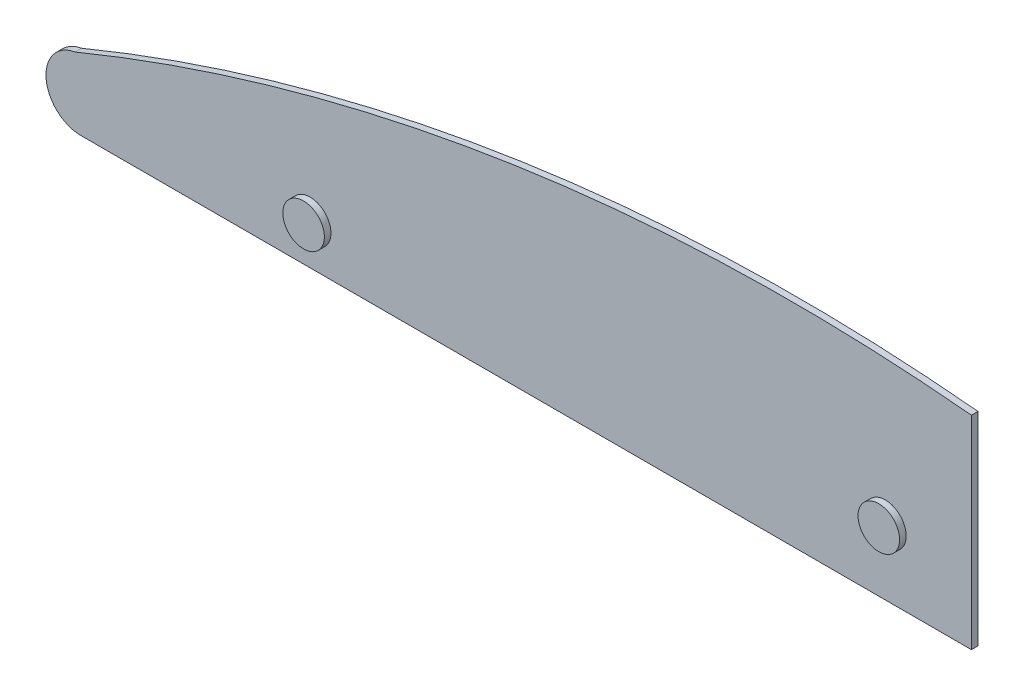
ISO-10303-21;
HEADER;
FILE_DESCRIPTION(('STEP AP214'),'2;1');
FILE_NAME('part.step','',(''),(''),'','','');
FILE_SCHEMA(('AUTOMOTIVE_DESIGN { 1 0 10303 214 1 1 1 1 }'));
ENDSEC;
DATA;
#1=APPLICATION_CONTEXT('core data for automotive mechanical design processes');
#2=APPLICATION_PROTOCOL_DEFINITION('international standard','automotive_design',2000,#1);
#3=PRODUCT_CONTEXT('',#1,'mechanical');
#4=PRODUCT('Part','Part','',(#3));
#5=PRODUCT_RELATED_PRODUCT_CATEGORY('part','',(#4));
#6=PRODUCT_DEFINITION_FORMATION('','',#4);
#7=PRODUCT_DEFINITION_CONTEXT('part definition',#1,'design');
#8=PRODUCT_DEFINITION('design','',#6,#7);
#9=PRODUCT_DEFINITION_SHAPE('','',#8);
#10=(LENGTH_UNIT() NAMED_UNIT(*) SI_UNIT(.MILLI.,.METRE.));
#11=(NAMED_UNIT(*) PLANE_ANGLE_UNIT() SI_UNIT($,.RADIAN.));
#12=(NAMED_UNIT(*) SI_UNIT($,.STERADIAN.) SOLID_ANGLE_UNIT());
#13=UNCERTAINTY_MEASURE_WITH_UNIT(LENGTH_MEASURE(1.E-05),#10,'distance_accuracy_value','');
#14=(GEOMETRIC_REPRESENTATION_CONTEXT(3) GLOBAL_UNCERTAINTY_ASSIGNED_CONTEXT((#13)) GLOBAL_UNIT_ASSIGNED_CONTEXT((#10,
#11,#12)) REPRESENTATION_CONTEXT('',''));
#15=CARTESIAN_POINT('',(0.,0.,0.));
#16=DIRECTION('',(0.,0.,1.));
#17=DIRECTION('',(1.,0.,0.));
#18=AXIS2_PLACEMENT_3D('',#15,#16,#17);
#19=CARTESIAN_POINT('',(-66.7637298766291,-682.284266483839,2.667));
#20=DIRECTION('',(0.,0.,1.));
#21=DIRECTION('',(1.,0.,0.));
#22=AXIS2_PLACEMENT_3D('',#19,#20,#21);
#23=PLANE('',#22);
#24=CARTESIAN_POINT('',(-262.437432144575,10.1041067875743,2.667));
#25=DIRECTION('',(0.,0.,1.));
#26=DIRECTION('',(1.,0.,0.));
#27=AXIS2_PLACEMENT_3D('',#24,#25,#26);
#28=CIRCLE('',#27,8.45095856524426);
#29=CARTESIAN_POINT('',(-253.986473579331,10.1041067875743,2.667));
#30=VERTEX_POINT('',#29);
#31=EDGE_CURVE('E89',#30,#30,#28,.T.);
#32=ORIENTED_EDGE('',*,*,#31,.F.);
#33=EDGE_LOOP('',(#32));
#34=FACE_BOUND('',#33,.T.);
#35=DIRECTION('',(1.,0.,0.));
#36=VECTOR('',#35,1.);
#37=CARTESIAN_POINT('',(-355.6,-6.35000000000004,2.667));
#38=LINE('',#37,#36);
#39=CARTESIAN_POINT('',(-355.6,-6.35000000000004,2.667));
#40=VERTEX_POINT('',#39);
#41=CARTESIAN_POINT('',(6.35000000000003,-6.35,2.667));
#42=VERTEX_POINT('',#41);
#43=EDGE_CURVE('E96',#40,#42,#38,.T.);
#44=ORIENTED_EDGE('',*,*,#43,.T.);
#45=DIRECTION('',(0.,1.,0.));
#46=VECTOR('',#45,1.);
#47=CARTESIAN_POINT('',(6.35000000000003,-6.35,2.667));
#48=LINE('',#47,#46);
#49=CARTESIAN_POINT('',(6.35000000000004,76.2,2.667));
#50=VERTEX_POINT('',#49);
#51=EDGE_CURVE('E81',#42,#50,#48,.T.);
#52=ORIENTED_EDGE('',*,*,#51,.T.);
#53=CARTESIAN_POINT('',(-66.7637298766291,-682.284266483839,2.667));
#54=DIRECTION('',(0.,0.,1.));
#55=DIRECTION('',(1.,0.,0.));
#56=AXIS2_PLACEMENT_3D('',#53,#54,#55);
#57=CIRCLE('',#56,762.);
#58=CARTESIAN_POINT('',(-357.978470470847,21.8733684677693,2.667));
#59=VERTEX_POINT('',#58);
#60=EDGE_CURVE('E48',#50,#59,#57,.T.);
#61=ORIENTED_EDGE('',*,*,#60,.T.);
#62=CARTESIAN_POINT('',(-355.6,7.86190476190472,2.667));
#63=DIRECTION('',(0.,0.,1.));
#64=DIRECTION('',(1.,0.,0.));
#65=AXIS2_PLACEMENT_3D('',#62,#63,#64);
#66=CIRCLE('',#65,14.2119047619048);
#67=EDGE_CURVE('E43',#59,#40,#66,.T.);
#68=ORIENTED_EDGE('',*,*,#67,.T.);
#69=EDGE_LOOP('',(#44,#52,#61,#68));
#70=FACE_BOUND('',#69,.T.);
#71=CARTESIAN_POINT('',(-28.6275785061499,20.4330561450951,2.667));
#72=DIRECTION('',(0.,0.,1.));
#73=DIRECTION('',(1.,0.,0.));
#74=AXIS2_PLACEMENT_3D('',#71,#72,#73);
#75=CIRCLE('',#74,8.45095856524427);
#76=CARTESIAN_POINT('',(-20.1766199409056,20.4330561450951,2.667));
#77=VERTEX_POINT('',#76);
#78=EDGE_CURVE('E114',#77,#77,#75,.T.);
#79=ORIENTED_EDGE('',*,*,#78,.F.);
#80=EDGE_LOOP('',(#79));
#81=FACE_BOUND('',#80,.T.);
#82=ADVANCED_FACE('F28',(#34,#70,#81),#23,.T.);
#83=CARTESIAN_POINT('',(-355.6,-6.35000000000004,2.667));
#84=DIRECTION('',(0.,1.,0.));
#85=DIRECTION('',(-1.,0.,0.));
#86=AXIS2_PLACEMENT_3D('',#83,#84,#85);
#87=PLANE('',#86);
#88=DIRECTION('',(1.,0.,0.));
#89=VECTOR('',#88,1.);
#90=CARTESIAN_POINT('',(-355.6,-6.35000000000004,0.));
#91=LINE('',#90,#89);
#92=CARTESIAN_POINT('',(-355.6,-6.35000000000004,0.));
#93=VERTEX_POINT('',#92);
#94=CARTESIAN_POINT('',(6.35000000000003,-6.35,0.));
#95=VERTEX_POINT('',#94);
#96=EDGE_CURVE('E73',#93,#95,#91,.T.);
#97=ORIENTED_EDGE('',*,*,#96,.T.);
#98=DIRECTION('',(0.,0.,-1.));
#99=VECTOR('',#98,1.);
#100=CARTESIAN_POINT('',(6.35000000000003,-6.35,2.667));
#101=LINE('',#100,#99);
#102=EDGE_CURVE('E11',#42,#95,#101,.T.);
#103=ORIENTED_EDGE('',*,*,#102,.F.);
#104=ORIENTED_EDGE('',*,*,#43,.F.);
#105=DIRECTION('',(0.,0.,-1.));
#106=VECTOR('',#105,1.);
#107=CARTESIAN_POINT('',(-355.6,-6.35000000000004,2.667));
#108=LINE('',#107,#106);
#109=EDGE_CURVE('E85',#40,#93,#108,.T.);
#110=ORIENTED_EDGE('',*,*,#109,.T.);
#111=EDGE_LOOP('',(#97,#103,#104,#110));
#112=FACE_BOUND('',#111,.T.);
#113=ADVANCED_FACE('F30',(#112),#87,.F.);
#114=CARTESIAN_POINT('',(6.35000000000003,-6.35,2.667));
#115=DIRECTION('',(-1.,0.,0.));
#116=DIRECTION('',(0.,-1.,0.));
#117=AXIS2_PLACEMENT_3D('',#114,#115,#116);
#118=PLANE('',#117);
#119=DIRECTION('',(0.,1.,0.));
#120=VECTOR('',#119,1.);
#121=CARTESIAN_POINT('',(6.35000000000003,-6.35,0.));
#122=LINE('',#121,#120);
#123=CARTESIAN_POINT('',(6.35000000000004,76.2,0.));
#124=VERTEX_POINT('',#123);
#125=EDGE_CURVE('E69',#95,#124,#122,.T.);
#126=ORIENTED_EDGE('',*,*,#125,.T.);
#127=DIRECTION('',(0.,0.,-1.));
#128=VECTOR('',#127,1.);
#129=CARTESIAN_POINT('',(6.35000000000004,76.2,2.667));
#130=LINE('',#129,#128);
#131=EDGE_CURVE('E36',#50,#124,#130,.T.);
#132=ORIENTED_EDGE('',*,*,#131,.F.);
#133=ORIENTED_EDGE('',*,*,#51,.F.);
#134=ORIENTED_EDGE('',*,*,#102,.T.);
#135=EDGE_LOOP('',(#126,#132,#133,#134));
#136=FACE_BOUND('',#135,.T.);
#137=ADVANCED_FACE('F80',(#136),#118,.F.);
#138=CARTESIAN_POINT('',(-66.7637298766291,-682.284266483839,2.667));
#139=DIRECTION('',(0.,0.,-1.));
#140=DIRECTION('',(-1.,0.,0.));
#141=AXIS2_PLACEMENT_3D('',#138,#139,#140);
#142=CYLINDRICAL_SURFACE('',#141,762.);
#143=CARTESIAN_POINT('',(-66.7637298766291,-682.284266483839,0.));
#144=DIRECTION('',(0.,0.,1.));
#145=DIRECTION('',(1.,0.,0.));
#146=AXIS2_PLACEMENT_3D('',#143,#144,#145);
#147=CIRCLE('',#146,762.);
#148=CARTESIAN_POINT('',(-357.978470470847,21.8733684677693,0.));
#149=VERTEX_POINT('',#148);
#150=EDGE_CURVE('E74',#124,#149,#147,.T.);
#151=ORIENTED_EDGE('',*,*,#150,.T.);
#152=DIRECTION('',(0.,0.,-1.));
#153=VECTOR('',#152,1.);
#154=CARTESIAN_POINT('',(-357.978470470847,21.8733684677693,2.667));
#155=LINE('',#154,#153);
#156=EDGE_CURVE('E102',#59,#149,#155,.T.);
#157=ORIENTED_EDGE('',*,*,#156,.F.);
#158=ORIENTED_EDGE('',*,*,#60,.F.);
#159=ORIENTED_EDGE('',*,*,#131,.T.);
#160=EDGE_LOOP('',(#151,#157,#158,#159));
#161=FACE_BOUND('',#160,.T.);
#162=ADVANCED_FACE('F105',(#161),#142,.T.);
#163=CARTESIAN_POINT('',(-355.6,7.86190476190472,2.667));
#164=DIRECTION('',(0.,0.,-1.));
#165=DIRECTION('',(-1.,0.,0.));
#166=AXIS2_PLACEMENT_3D('',#163,#164,#165);
#167=CYLINDRICAL_SURFACE('',#166,14.2119047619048);
#168=CARTESIAN_POINT('',(-355.6,7.86190476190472,0.));
#169=DIRECTION('',(0.,0.,1.));
#170=DIRECTION('',(1.,0.,0.));
#171=AXIS2_PLACEMENT_3D('',#168,#169,#170);
#172=CIRCLE('',#171,14.2119047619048);
#173=EDGE_CURVE('E94',#149,#93,#172,.T.);
#174=ORIENTED_EDGE('',*,*,#173,.T.);
#175=ORIENTED_EDGE('',*,*,#109,.F.);
#176=ORIENTED_EDGE('',*,*,#67,.F.);
#177=ORIENTED_EDGE('',*,*,#156,.T.);
#178=EDGE_LOOP('',(#174,#175,#176,#177));
#179=FACE_BOUND('',#178,.T.);
#180=ADVANCED_FACE('F107',(#179),#167,.T.);
#181=CARTESIAN_POINT('',(-66.7637298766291,-682.284266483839,0.));
#182=DIRECTION('',(0.,0.,1.));
#183=DIRECTION('',(1.,0.,0.));
#184=AXIS2_PLACEMENT_3D('',#181,#182,#183);
#185=PLANE('',#184);
#186=ORIENTED_EDGE('',*,*,#96,.F.);
#187=ORIENTED_EDGE('',*,*,#173,.F.);
#188=ORIENTED_EDGE('',*,*,#150,.F.);
#189=ORIENTED_EDGE('',*,*,#125,.F.);
#190=EDGE_LOOP('',(#186,#187,#188,#189));
#191=FACE_BOUND('',#190,.T.);
#192=ADVANCED_FACE('F70',(#191),#185,.F.);
#193=CARTESIAN_POINT('',(-262.437432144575,10.1041067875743,5.334));
#194=DIRECTION('',(0.,0.,-1.));
#195=DIRECTION('',(-1.,0.,0.));
#196=AXIS2_PLACEMENT_3D('',#193,#194,#195);
#197=CYLINDRICAL_SURFACE('',#196,8.45095856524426);
#198=CARTESIAN_POINT('',(-262.437432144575,10.1041067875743,5.334));
#199=DIRECTION('',(0.,0.,1.));
#200=DIRECTION('',(1.,0.,0.));
#201=AXIS2_PLACEMENT_3D('',#198,#199,#200);
#202=CIRCLE('',#201,8.45095856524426);
#203=CARTESIAN_POINT('',(-253.986473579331,10.1041067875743,5.334));
#204=VERTEX_POINT('',#203);
#205=EDGE_CURVE('E86',#204,#204,#202,.T.);
#206=ORIENTED_EDGE('',*,*,#205,.F.);
#207=EDGE_LOOP('',(#206));
#208=FACE_BOUND('',#207,.T.);
#209=ORIENTED_EDGE('',*,*,#31,.T.);
#210=EDGE_LOOP('',(#209));
#211=FACE_BOUND('',#210,.T.);
#212=ADVANCED_FACE('F123',(#208,#211),#197,.T.);
#213=CARTESIAN_POINT('',(-262.437432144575,10.1041067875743,5.334));
#214=DIRECTION('',(0.,0.,1.));
#215=DIRECTION('',(1.,0.,0.));
#216=AXIS2_PLACEMENT_3D('',#213,#214,#215);
#217=PLANE('',#216);
#218=ORIENTED_EDGE('',*,*,#205,.T.);
#219=EDGE_LOOP('',(#218));
#220=FACE_BOUND('',#219,.T.);
#221=ADVANCED_FACE('F125',(#220),#217,.T.);
#222=CARTESIAN_POINT('',(-28.6275785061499,20.4330561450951,5.334));
#223=DIRECTION('',(0.,0.,-1.));
#224=DIRECTION('',(-1.,0.,0.));
#225=AXIS2_PLACEMENT_3D('',#222,#223,#224);
#226=CYLINDRICAL_SURFACE('',#225,8.45095856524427);
#227=CARTESIAN_POINT('',(-28.6275785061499,20.4330561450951,5.334));
#228=DIRECTION('',(0.,0.,1.));
#229=DIRECTION('',(1.,0.,0.));
#230=AXIS2_PLACEMENT_3D('',#227,#228,#229);
#231=CIRCLE('',#230,8.45095856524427);
#232=CARTESIAN_POINT('',(-20.1766199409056,20.4330561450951,5.334));
#233=VERTEX_POINT('',#232);
#234=EDGE_CURVE('E116',#233,#233,#231,.T.);
#235=ORIENTED_EDGE('',*,*,#234,.F.);
#236=EDGE_LOOP('',(#235));
#237=FACE_BOUND('',#236,.T.);
#238=ORIENTED_EDGE('',*,*,#78,.T.);
#239=EDGE_LOOP('',(#238));
#240=FACE_BOUND('',#239,.T.);
#241=ADVANCED_FACE('F131',(#237,#240),#226,.T.);
#242=CARTESIAN_POINT('',(-28.6275785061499,20.4330561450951,5.334));
#243=DIRECTION('',(0.,0.,1.));
#244=DIRECTION('',(1.,0.,0.));
#245=AXIS2_PLACEMENT_3D('',#242,#243,#244);
#246=PLANE('',#245);
#247=ORIENTED_EDGE('',*,*,#234,.T.);
#248=EDGE_LOOP('',(#247));
#249=FACE_BOUND('',#248,.T.);
#250=ADVANCED_FACE('F179',(#249),#246,.T.);
#251=CLOSED_SHELL('',(#82,#113,#137,#162,#180,#192,#212,#221,#241,#250));
#252=MANIFOLD_SOLID_BREP('B2',#251);
#253=ADVANCED_BREP_SHAPE_REPRESENTATION('',(#18,#252),#14);
#254=SHAPE_DEFINITION_REPRESENTATION(#9,#253);
ENDSEC;
END-ISO-10303-21;
